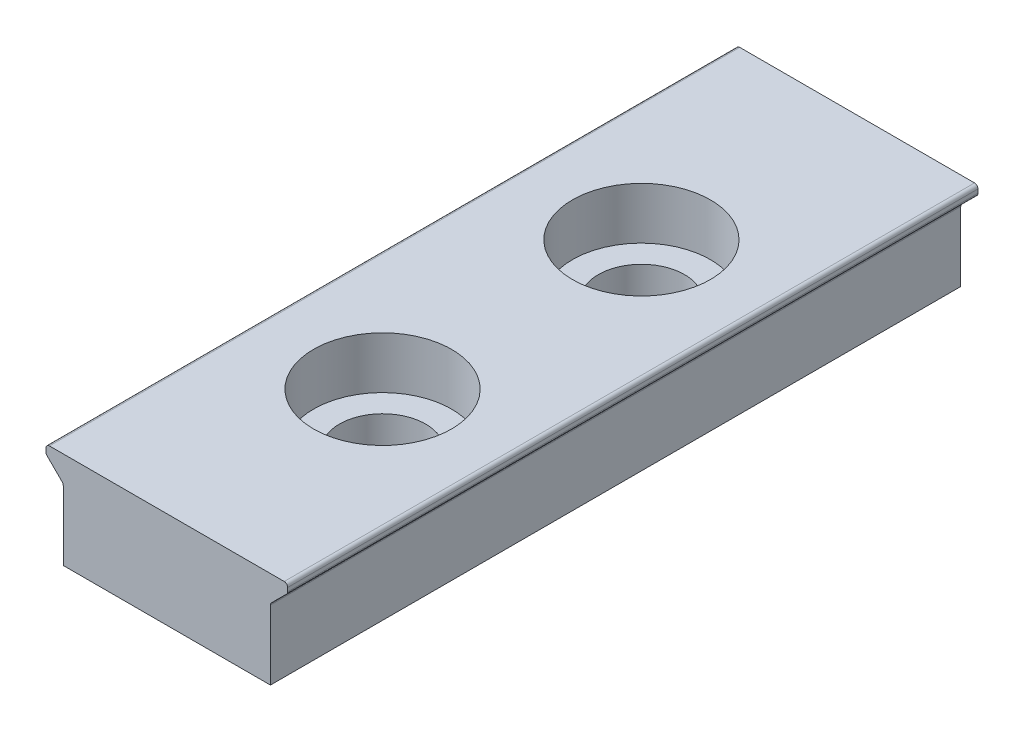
from build123d import *

# Parameters (mm, degrees)
EXTRUDE3_DEPTH       = 20
FILLET1_R            = 0.1
FILLET1_OF_MIRROR1_R = 0.1
LPATTERN1_COUNT      = 2
LPATTERN1_PITCH      = 7.5


with BuildPart() as part:
    # Sketch2 → Extrude3 (new body)
    with BuildSketch(Plane.XY):
        Polygon((0, 2.8), (3.50101, 2.8), (3.50101, 2.55), (3.00101, 2.05), (3.00101, 0), (0, 0), align=None)
    extrude3 = extrude(amount=EXTRUDE3_DEPTH)

    # Fillet1
    fillet1_edges = [part.edges().sort_by_distance(p)[0] for p in [
        (3.50101, 2.55, 10),
        (3.00101, 2.05, 10),
        (3.50101, 2.8, 10),
    ]]
    fillet(fillet1_edges, radius=FILLET1_R)

    # Mirror1: Extrude3 across plane
    add(extrude3.mirror(Plane(origin=(0, 0, 0), x_dir=(0, 0, 1), z_dir=(1, 0, 0))))

    # Fillet1 of Mirror1
    fillet1_of_mirror1_edges = [part.edges().sort_by_distance(p)[0] for p in [
        (-3.50101, 2.55, 10),
        (-3.00101, 2.05, 10),
        (-3.50101, 2.8, 10),
    ]]
    fillet(fillet1_of_mirror1_edges, radius=FILLET1_OF_MIRROR1_R)

    # Sketch3 → CBORE for M3 SBHCS1 (revolve, cut)
    with BuildSketch(Plane(origin=(0, 2.8, 6.25), x_dir=(0, 0, 1), z_dir=(1, 0, 0))):
        Polygon((0, 0), (0, 26.151075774), (1.25, 25.4), (1.25, 1.5), (2, 1.5), (2, 0), align=None)
    cbore_for_m3_sbhcs1 = revolve(axis=Axis((0, 9.15, 6.25), (0, -1, 0)), mode=Mode.SUBTRACT)

    # LPattern1: CBORE for M3 SBHCS1 ×2
    with Locations(*[(0, 0, i * LPATTERN1_PITCH) for i in range(1, LPATTERN1_COUNT)]):
        add(cbore_for_m3_sbhcs1, mode=Mode.SUBTRACT)


solid = part.part
